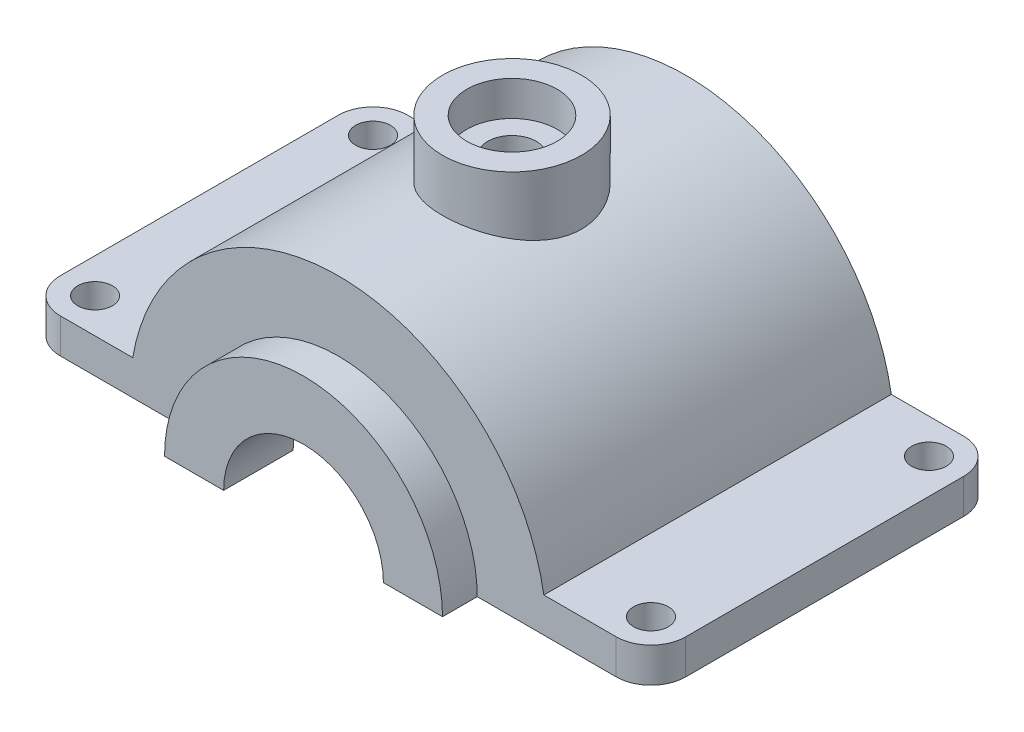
from build123d import *

# Parameters (mm, degrees)
EXTRUDE_1_DEPTH      = 40
EXTRUDE_START        = 10
EXTRUDE_2_DEPTH      = 10
EXTRUDE_3_DEPTH      = 10
CUT_EXTRUDE_1_DEPTH  = 20
EXTRUDE_4_REACH      = 133.624
EXTRUDE_4_END_RADIUS = 60
SKETCH_5_R           = 20
SKETCH_6_R           = 7
CUT_EXTRUDE_2_DEPTH  = 132.624465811
SKETCH_7_R           = 13
CUT_EXTRUDE_3_DEPTH  = 10
FILLET_1_R           = 10
SKETCH_8_R           = 5
CUT_EXTRUDE_4_DEPTH  = 10


with BuildPart() as part:
    # Sketch 1 → Extrude 1 (new, symmetric)
    with BuildSketch(Plane.XY):
        with BuildLine():
            Line((59.160797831, 10), (90, 10))
            Line((90, 10), (90, 0))
            Line((90, 0), (50, 0))
            ThreePointArc((50, 0), (0, 50), (-50, 0))
            Line((-50, 0), (-90, 0))
            Line((-90, 0), (-90, 10))
            Line((-90, 10), (-59.160797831, 10))
            ThreePointArc((-59.160797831, 10), (0, 60), (59.160797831, 10))
        make_face()
    extrude(amount=EXTRUDE_1_DEPTH, both=True)

    # Sketch 2 → Extrude 2 (add)
    with BuildSketch(Plane.XY.offset(40).offset(EXTRUDE_START)):
        with BuildLine():
            Line((90, 0), (90, 10))
            Line((90, 10), (59.160797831, 10))
            ThreePointArc((59.160797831, 10), (0, 60), (-59.160797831, 10))
            Line((-59.160797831, 10), (-90, 10))
            Line((-90, 10), (-90, 0))
            Line((-90, 0), (90, 0))
        make_face()
    extrude_2 = extrude(amount=-EXTRUDE_2_DEPTH)

    # Mirror 1: Extrude 2 across plane
    add(extrude_2.mirror(Plane.XY))

    # Sketch 3 → Extrude 3 (add)
    with BuildSketch(Plane.XY.offset(50)):
        with BuildLine():
            Line((-40, 0), (40, 0))
            ThreePointArc((40, 0), (0, 40), (-40, 0))
        make_face()
    extrude(amount=EXTRUDE_3_DEPTH)

    # Sketch 4 → Cut-Extrude 1 (cut)
    with BuildSketch(Plane.XY.offset(60)):
        with BuildLine():
            Line((22.988512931, 0), (-22.988512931, 0))
            ThreePointArc((-22.988512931, 0), (0, 22.988512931), (22.988512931, 0))
        make_face()
    extrude(amount=-CUT_EXTRUDE_1_DEPTH, mode=Mode.SUBTRACT)

    # Extrude 4: up to this cylinder (the profile starts outside it)
    extrude_4_end = Plane(origin=(0, 0, 0), z_dir=(0, 0, -1)) * Cylinder(EXTRUDE_4_END_RADIUS, 388.248, mode=Mode.PRIVATE)
    # Sketch 5 → Extrude 4 (add, up to the surface)
    with BuildSketch(Plane(origin=(0, 75, 0), x_dir=(-1, 0, 0), z_dir=(0, 1, 0)), mode=Mode.PRIVATE) as extrude_4_sk1:
        with Locations(Location((0, 0, 0), (0, 0, 90))):
            Circle(SKETCH_5_R)
    extrude_4_tool1 = extrude(extrude_4_sk1.sketch, amount=-EXTRUDE_4_REACH, mode=Mode.PRIVATE) - extrude_4_end
    add(extrude_4_tool1.solids().sort_by_distance((0, 75, 0))[0])

    # Sketch 6 → Cut-Extrude 2 (cut, through all)
    with BuildSketch(Plane(origin=(0, 75, 0), x_dir=(1, 0, 0), z_dir=(0, 1, 0))):
        with Locations(Location((0, 0, 0), (0, 0, 270))):
            Circle(SKETCH_6_R)
    extrude(amount=-CUT_EXTRUDE_2_DEPTH, mode=Mode.SUBTRACT)

    # Sketch 7 → Cut-Extrude 3 (cut)
    with BuildSketch(Plane(origin=(0, 75, 0), x_dir=(1, 0, 0), z_dir=(0, 1, 0))):
        with Locations(Location((0, 0, 0), (0, 0, 270))):
            Circle(SKETCH_7_R)
    extrude(amount=-CUT_EXTRUDE_3_DEPTH, mode=Mode.SUBTRACT)

    # Fillet 1
    fillet_1_edges = [part.edges().sort_by_distance(p)[0] for p in [
        (90, 5, 50),
        (-90, 5, 50),
        (-90, 5, -50),
        (90, 5, -50),
    ]]
    fillet(fillet_1_edges, radius=FILLET_1_R)

    # Sketch 8 → Cut-Extrude 4 (cut)
    with BuildSketch(Plane(origin=(0, 10, 0), x_dir=(1, 0, 0), z_dir=(0, 1, 0))):
        with Locations(Location((80, 40, 0), (0, 0, 270))):
            Circle(SKETCH_8_R)
        with Locations(Location((80, -40, 0), (0, 0, 270))):
            Circle(SKETCH_8_R)
    cut_extrude_4 = extrude(amount=-CUT_EXTRUDE_4_DEPTH, mode=Mode.SUBTRACT)

    # Mirror 2: Cut-Extrude 4 across plane
    add(cut_extrude_4.mirror(Plane(origin=(0, 0, 0), x_dir=(0, 0, 1), z_dir=(1, 0, 0))), mode=Mode.SUBTRACT)


solid = part.part
